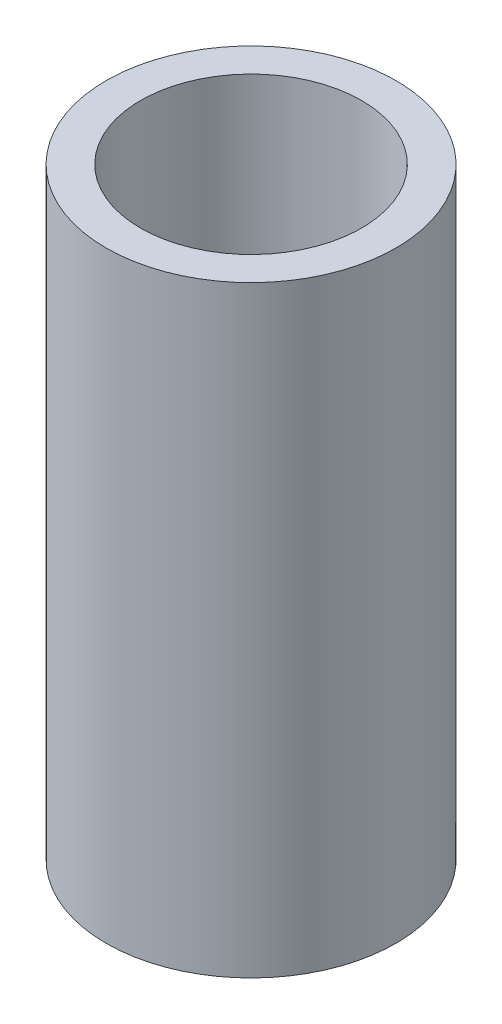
ISO-10303-21;
HEADER;
FILE_DESCRIPTION(('STEP AP214'),'2;1');
FILE_NAME('part.step','',(''),(''),'','','');
FILE_SCHEMA(('AUTOMOTIVE_DESIGN { 1 0 10303 214 1 1 1 1 }'));
ENDSEC;
DATA;
#1=APPLICATION_CONTEXT('core data for automotive mechanical design processes');
#2=APPLICATION_PROTOCOL_DEFINITION('international standard','automotive_design',2000,#1);
#3=PRODUCT_CONTEXT('',#1,'mechanical');
#4=PRODUCT('Part','Part','',(#3));
#5=PRODUCT_RELATED_PRODUCT_CATEGORY('part','',(#4));
#6=PRODUCT_DEFINITION_FORMATION('','',#4);
#7=PRODUCT_DEFINITION_CONTEXT('part definition',#1,'design');
#8=PRODUCT_DEFINITION('design','',#6,#7);
#9=PRODUCT_DEFINITION_SHAPE('','',#8);
#10=(LENGTH_UNIT() NAMED_UNIT(*) SI_UNIT(.MILLI.,.METRE.));
#11=(NAMED_UNIT(*) PLANE_ANGLE_UNIT() SI_UNIT($,.RADIAN.));
#12=(NAMED_UNIT(*) SI_UNIT($,.STERADIAN.) SOLID_ANGLE_UNIT());
#13=UNCERTAINTY_MEASURE_WITH_UNIT(LENGTH_MEASURE(1.E-05),#10,'distance_accuracy_value','');
#14=(GEOMETRIC_REPRESENTATION_CONTEXT(3) GLOBAL_UNCERTAINTY_ASSIGNED_CONTEXT((#13)) GLOBAL_UNIT_ASSIGNED_CONTEXT((#10,
#11,#12)) REPRESENTATION_CONTEXT('',''));
#15=CARTESIAN_POINT('',(0.,0.,0.));
#16=DIRECTION('',(0.,0.,1.));
#17=DIRECTION('',(1.,0.,0.));
#18=AXIS2_PLACEMENT_3D('',#15,#16,#17);
#19=CARTESIAN_POINT('',(-711.885302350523,1394.63951986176,0.));
#20=DIRECTION('',(0.,1.,0.));
#21=DIRECTION('',(0.,0.,1.));
#22=AXIS2_PLACEMENT_3D('',#19,#20,#21);
#23=CYLINDRICAL_SURFACE('',#22,16.85);
#24=CARTESIAN_POINT('',(-711.885302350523,1244.,0.));
#25=DIRECTION('',(0.,1.,0.));
#26=DIRECTION('',(0.,0.,1.));
#27=AXIS2_PLACEMENT_3D('',#24,#25,#26);
#28=CIRCLE('',#27,16.85);
#29=CARTESIAN_POINT('',(-711.885302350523,1244.,16.85));
#30=VERTEX_POINT('',#29);
#31=EDGE_CURVE('E10',#30,#30,#28,.T.);
#32=ORIENTED_EDGE('',*,*,#31,.T.);
#33=EDGE_LOOP('',(#32));
#34=FACE_BOUND('',#33,.T.);
#35=CARTESIAN_POINT('',(-711.885302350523,1314.,0.));
#36=DIRECTION('',(0.,1.,0.));
#37=DIRECTION('',(0.,0.,1.));
#38=AXIS2_PLACEMENT_3D('',#35,#36,#37);
#39=CIRCLE('',#38,16.85);
#40=CARTESIAN_POINT('',(-711.885302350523,1314.,16.85));
#41=VERTEX_POINT('',#40);
#42=EDGE_CURVE('E42',#41,#41,#39,.T.);
#43=ORIENTED_EDGE('',*,*,#42,.F.);
#44=EDGE_LOOP('',(#43));
#45=FACE_BOUND('',#44,.T.);
#46=ADVANCED_FACE('F28',(#34,#45),#23,.T.);
#47=CARTESIAN_POINT('',(-728.735302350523,1244.,0.));
#48=DIRECTION('',(0.,-1.,0.));
#49=DIRECTION('',(0.,0.,-1.));
#50=AXIS2_PLACEMENT_3D('',#47,#48,#49);
#51=PLANE('',#50);
#52=CARTESIAN_POINT('',(-711.885302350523,1244.,0.));
#53=DIRECTION('',(0.,1.,0.));
#54=DIRECTION('',(0.,0.,1.));
#55=AXIS2_PLACEMENT_3D('',#52,#53,#54);
#56=CIRCLE('',#55,12.85);
#57=CARTESIAN_POINT('',(-711.885302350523,1244.,12.85));
#58=VERTEX_POINT('',#57);
#59=EDGE_CURVE('E34',#58,#58,#56,.T.);
#60=ORIENTED_EDGE('',*,*,#59,.T.);
#61=EDGE_LOOP('',(#60));
#62=FACE_BOUND('',#61,.T.);
#63=ORIENTED_EDGE('',*,*,#31,.F.);
#64=EDGE_LOOP('',(#63));
#65=FACE_BOUND('',#64,.T.);
#66=ADVANCED_FACE('F52',(#62,#65),#51,.T.);
#67=CARTESIAN_POINT('',(-711.885302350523,1394.63951986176,0.));
#68=DIRECTION('',(0.,1.,0.));
#69=DIRECTION('',(0.,0.,1.));
#70=AXIS2_PLACEMENT_3D('',#67,#68,#69);
#71=CYLINDRICAL_SURFACE('',#70,12.85);
#72=CARTESIAN_POINT('',(-711.885302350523,1314.,0.));
#73=DIRECTION('',(0.,1.,0.));
#74=DIRECTION('',(0.,0.,1.));
#75=AXIS2_PLACEMENT_3D('',#72,#73,#74);
#76=CIRCLE('',#75,12.85);
#77=CARTESIAN_POINT('',(-711.885302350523,1314.,12.85));
#78=VERTEX_POINT('',#77);
#79=EDGE_CURVE('E38',#78,#78,#76,.T.);
#80=ORIENTED_EDGE('',*,*,#79,.T.);
#81=EDGE_LOOP('',(#80));
#82=FACE_BOUND('',#81,.T.);
#83=ORIENTED_EDGE('',*,*,#59,.F.);
#84=EDGE_LOOP('',(#83));
#85=FACE_BOUND('',#84,.T.);
#86=ADVANCED_FACE('F56',(#82,#85),#71,.F.);
#87=CARTESIAN_POINT('',(-728.735302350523,1314.,0.));
#88=DIRECTION('',(0.,1.,0.));
#89=DIRECTION('',(0.,0.,1.));
#90=AXIS2_PLACEMENT_3D('',#87,#88,#89);
#91=PLANE('',#90);
#92=ORIENTED_EDGE('',*,*,#42,.T.);
#93=EDGE_LOOP('',(#92));
#94=FACE_BOUND('',#93,.T.);
#95=ORIENTED_EDGE('',*,*,#79,.F.);
#96=EDGE_LOOP('',(#95));
#97=FACE_BOUND('',#96,.T.);
#98=ADVANCED_FACE('F48',(#94,#97),#91,.T.);
#99=CLOSED_SHELL('',(#46,#66,#86,#98));
#100=MANIFOLD_SOLID_BREP('B2',#99);
#101=ADVANCED_BREP_SHAPE_REPRESENTATION('',(#18,#100),#14);
#102=SHAPE_DEFINITION_REPRESENTATION(#9,#101);
ENDSEC;
END-ISO-10303-21;
